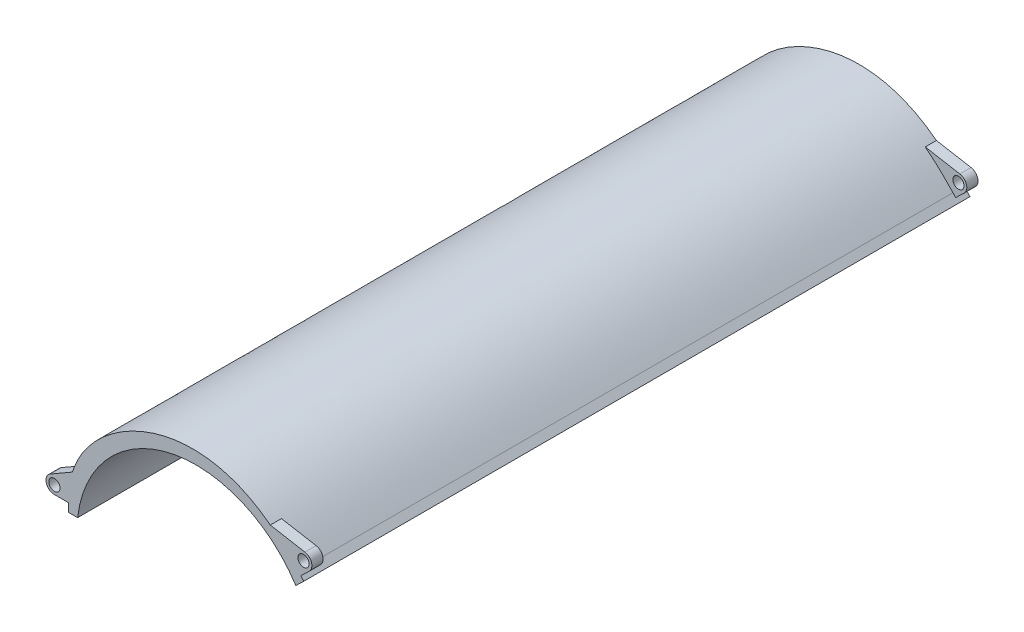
from build123d import *

# Parameters (mm, degrees)
BOSS_EXTRUDE1_DEPTH = 595
BOSS_EXTRUDE2_START = 595
SKETCH3_R           = 10
BOSS_EXTRUDE2_DEPTH = 20
BOSS_EXTRUDE3_START = -575
SKETCH3_4_R         = 10
BOSS_EXTRUDE3_DEPTH = 20


with BuildPart() as part:
    # Sketch1 → Boss-Extrude1 (new, symmetric)
    with BuildSketch(Plane.XY):
        with BuildLine():
            Line((-59.323974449, 128.759639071), (-73.741375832, 114.898234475))
            ThreePointArc((-73.741375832, 114.898234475), (-300.256584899, 207.064141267), (-463.524287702, 25))
            Line((-463.524287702, 25), (-479.524287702, 25))
            Line((-479.524287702, 25), (-479.524287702, 50))
            add(Edge.make_bspline(
                [(-69.720027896, 139.572690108), (-108.18754722, 179.583185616), (-152.416815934, 225.586540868), (-219.133886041, 251.435560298), (-287.408844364, 253.328836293), (-359.356081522, 236.563554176), (-477.15378099, 170.567422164), (-479.524287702, 50)],
                knots=[0, 0, 0, 0, 0, 0, 0, 0, 1, 1, 1, 1, 1, 1, 1, 1], degree=7))
            Line((-69.720027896, 139.572690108), (-59.323974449, 128.759639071))
        make_face()
    extrude(amount=BOSS_EXTRUDE1_DEPTH, both=True)

    # Sketch3 → Boss-Extrude2 (add)
    # profile 1 of 2: a face of its own
    with BuildSketch(Plane.XY.offset(BOSS_EXTRUDE2_START)):
        with BuildLine():
            Line((-505, 40), (-479.524287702, 40))
            Line((-479.524287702, 40), (-479.524287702, 50.000000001))
            add(Edge.make_bspline(
                [(-472.826933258, 90.89563682), (-474.51705784, 85.487785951), (-475.993797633, 79.937195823), (-477.239796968, 74.242499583), (-478.236465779, 68.402452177), (-478.963896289, 62.415949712), (-479.400774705, 56.282050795), (-479.524287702, 50.000000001)],
                knots=[0.947895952, 0.947895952, 0.947895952, 0.947895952, 0.947895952, 0.947895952, 0.947895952, 0.947895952, 1, 1, 1, 1, 1, 1, 1, 1], degree=7))
            Line((-472.826933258, 90.89563682), (-512.5, 67.990381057))
            ThreePointArc((-512.5, 67.990381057), (-519.488887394, 51.117714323), (-505, 40))
        make_face()
        with Locations((-505, 55)):
            Circle(SKETCH3_R, mode=Mode.SUBTRACT)
    # profile 2 of 2: a face of its own
    with BuildSketch(Plane.XY.offset(BOSS_EXTRUDE2_START)):
        with BuildLine():
            Line((-49.603946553, 149.186948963), (-64.860756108, 134.518507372))
            Line((-64.860756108, 134.518507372), (-69.720027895, 139.572690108))
            add(Edge.make_bspline(
                [(-69.720027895, 139.572690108), (-76.074149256, 146.181682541), (-82.585479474, 152.954189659), (-89.329402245, 159.772367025), (-96.35326765, 166.535005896), (-103.683856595, 173.155904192), (-111.333957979, 179.561593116), (-119.307330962, 185.688881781)],
                knots=[0, 0, 0, 0, 0, 0, 0, 0, 0.165181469, 0.165181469, 0.165181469, 0.165181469, 0.165181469, 0.165181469, 0.165181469, 0.165181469], degree=7))
            Line((-119.307330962, 185.688881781), (-57.395277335, 174.772116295))
            ThreePointArc((-57.395277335, 174.772116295), (-45.650601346, 164.369754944), (-49.603946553, 149.186948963))
        make_face()
        with Locations((-60, 160)):
            Circle(SKETCH3_R, mode=Mode.SUBTRACT)
    extrude(amount=-BOSS_EXTRUDE2_DEPTH)

    # Sketch3_4 → Boss-Extrude3 (add)
    # profile 1 of 2: a face of its own
    with BuildSketch(Plane.XY.offset(BOSS_EXTRUDE3_START)):
        with BuildLine():
            Line((-505, 40), (-479.524287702, 40))
            Line((-479.524287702, 40), (-479.524287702, 50.000000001))
            add(Edge.make_bspline(
                [(-472.826933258, 90.89563682), (-474.51705784, 85.487785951), (-475.993797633, 79.937195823), (-477.239796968, 74.242499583), (-478.236465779, 68.402452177), (-478.963896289, 62.415949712), (-479.400774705, 56.282050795), (-479.524287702, 50.000000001)],
                knots=[0.947895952, 0.947895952, 0.947895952, 0.947895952, 0.947895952, 0.947895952, 0.947895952, 0.947895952, 1, 1, 1, 1, 1, 1, 1, 1], degree=7))
            Line((-472.826933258, 90.89563682), (-512.5, 67.990381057))
            ThreePointArc((-512.5, 67.990381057), (-519.488887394, 51.117714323), (-505, 40))
        make_face()
        with Locations((-505, 55)):
            Circle(SKETCH3_4_R, mode=Mode.SUBTRACT)
    # profile 2 of 2: a face of its own
    with BuildSketch(Plane.XY.offset(BOSS_EXTRUDE3_START)):
        with BuildLine():
            Line((-49.603946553, 149.186948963), (-64.860756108, 134.518507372))
            Line((-64.860756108, 134.518507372), (-69.720027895, 139.572690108))
            add(Edge.make_bspline(
                [(-69.720027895, 139.572690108), (-76.074149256, 146.181682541), (-82.585479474, 152.954189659), (-89.329402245, 159.772367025), (-96.35326765, 166.535005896), (-103.683856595, 173.155904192), (-111.333957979, 179.561593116), (-119.307330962, 185.688881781)],
                knots=[0, 0, 0, 0, 0, 0, 0, 0, 0.165181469, 0.165181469, 0.165181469, 0.165181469, 0.165181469, 0.165181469, 0.165181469, 0.165181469], degree=7))
            Line((-119.307330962, 185.688881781), (-57.395277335, 174.772116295))
            ThreePointArc((-57.395277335, 174.772116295), (-45.650601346, 164.369754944), (-49.603946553, 149.186948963))
        make_face()
        with Locations((-60, 160)):
            Circle(SKETCH3_4_R, mode=Mode.SUBTRACT)
    extrude(amount=-BOSS_EXTRUDE3_DEPTH)


solid = part.part
